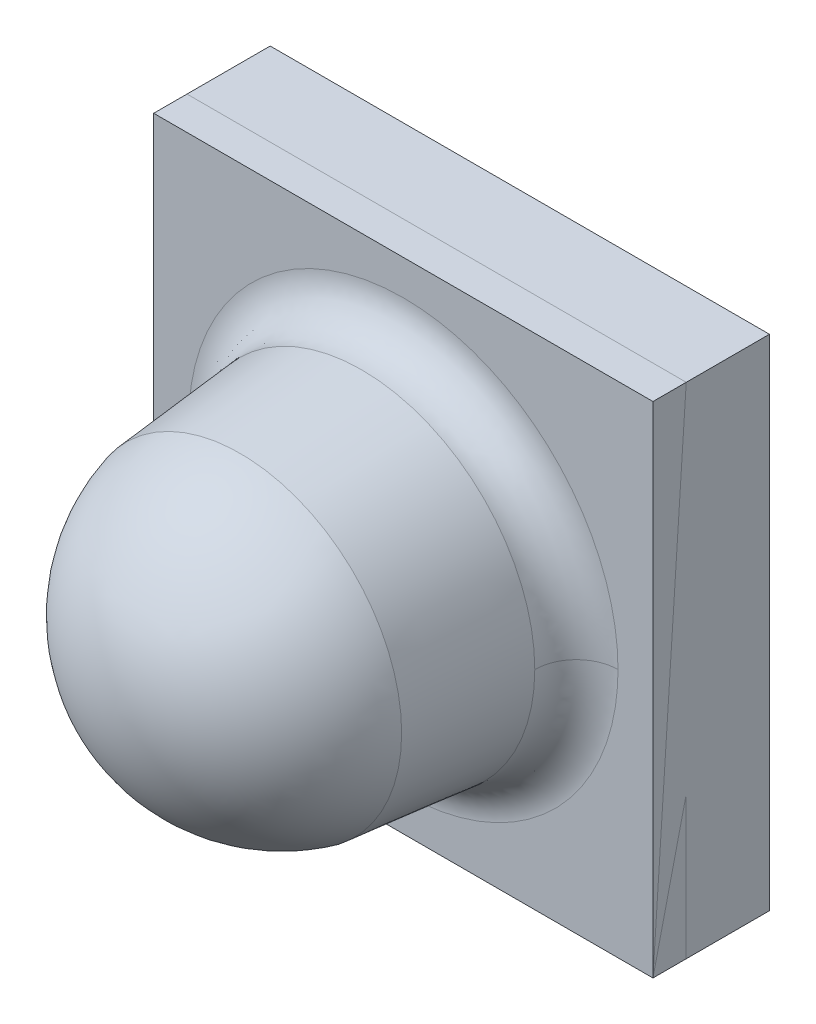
ISO-10303-21;
HEADER;
FILE_DESCRIPTION(('STEP AP214'),'2;1');
FILE_NAME('part.step','',(''),(''),'','','');
FILE_SCHEMA(('AUTOMOTIVE_DESIGN { 1 0 10303 214 1 1 1 1 }'));
ENDSEC;
DATA;
#1=APPLICATION_CONTEXT('core data for automotive mechanical design processes');
#2=APPLICATION_PROTOCOL_DEFINITION('international standard','automotive_design',2000,#1);
#3=PRODUCT_CONTEXT('',#1,'mechanical');
#4=PRODUCT('Part','Part','',(#3));
#5=PRODUCT_RELATED_PRODUCT_CATEGORY('part','',(#4));
#6=PRODUCT_DEFINITION_FORMATION('','',#4);
#7=PRODUCT_DEFINITION_CONTEXT('part definition',#1,'design');
#8=PRODUCT_DEFINITION('design','',#6,#7);
#9=PRODUCT_DEFINITION_SHAPE('','',#8);
#10=(LENGTH_UNIT() NAMED_UNIT(*) SI_UNIT(.MILLI.,.METRE.));
#11=(NAMED_UNIT(*) PLANE_ANGLE_UNIT() SI_UNIT($,.RADIAN.));
#12=(NAMED_UNIT(*) SI_UNIT($,.STERADIAN.) SOLID_ANGLE_UNIT());
#13=UNCERTAINTY_MEASURE_WITH_UNIT(LENGTH_MEASURE(1.E-05),#10,'distance_accuracy_value','');
#14=(GEOMETRIC_REPRESENTATION_CONTEXT(3) GLOBAL_UNCERTAINTY_ASSIGNED_CONTEXT((#13)) GLOBAL_UNIT_ASSIGNED_CONTEXT((#10,
#11,#12)) REPRESENTATION_CONTEXT('',''));
#15=CARTESIAN_POINT('',(0.,0.,0.));
#16=DIRECTION('',(0.,0.,1.));
#17=DIRECTION('',(1.,0.,0.));
#18=AXIS2_PLACEMENT_3D('',#15,#16,#17);
#19=CARTESIAN_POINT('',(-1.5,1.5,0.));
#20=DIRECTION('',(-1.,0.,0.));
#21=DIRECTION('',(0.,0.,1.));
#22=AXIS2_PLACEMENT_3D('',#19,#20,#21);
#23=PLANE('',#22);
#24=DIRECTION('',(0.,-1.,0.));
#25=VECTOR('',#24,1.);
#26=CARTESIAN_POINT('',(-1.5,1.5,0.2));
#27=LINE('',#26,#25);
#28=CARTESIAN_POINT('',(-1.5,1.5,0.2));
#29=VERTEX_POINT('',#28);
#30=CARTESIAN_POINT('',(-1.5,-1.5,0.2));
#31=VERTEX_POINT('',#30);
#32=EDGE_CURVE('P0_E81',#29,#31,#27,.T.);
#33=ORIENTED_EDGE('',*,*,#32,.F.);
#34=DIRECTION('',(0.,0.,1.));
#35=VECTOR('',#34,1.);
#36=CARTESIAN_POINT('',(-1.5,1.5,0.));
#37=LINE('',#36,#35);
#38=CARTESIAN_POINT('',(-1.5,1.5,0.));
#39=VERTEX_POINT('',#38);
#40=EDGE_CURVE('P0_E11',#39,#29,#37,.T.);
#41=ORIENTED_EDGE('',*,*,#40,.F.);
#42=DIRECTION('',(0.,-1.,0.));
#43=VECTOR('',#42,1.);
#44=CARTESIAN_POINT('',(-1.5,1.5,0.));
#45=LINE('',#44,#43);
#46=CARTESIAN_POINT('',(-1.5,-1.5,0.));
#47=VERTEX_POINT('',#46);
#48=EDGE_CURVE('P0_E75',#39,#47,#45,.T.);
#49=ORIENTED_EDGE('',*,*,#48,.T.);
#50=DIRECTION('',(0.,0.,1.));
#51=VECTOR('',#50,1.);
#52=CARTESIAN_POINT('',(-1.5,-1.5,0.));
#53=LINE('',#52,#51);
#54=EDGE_CURVE('P0_E20',#47,#31,#53,.T.);
#55=ORIENTED_EDGE('',*,*,#54,.T.);
#56=EDGE_LOOP('',(#33,#41,#49,#55));
#57=FACE_BOUND('',#56,.T.);
#58=ADVANCED_FACE('P0_F17',(#57),#23,.T.);
#59=CARTESIAN_POINT('',(-1.5,1.5,0.));
#60=DIRECTION('',(0.,1.,0.));
#61=DIRECTION('',(0.,0.,1.));
#62=AXIS2_PLACEMENT_3D('',#59,#60,#61);
#63=PLANE('',#62);
#64=DIRECTION('',(-1.,0.,0.));
#65=VECTOR('',#64,1.);
#66=CARTESIAN_POINT('',(-1.5,1.5,0.2));
#67=LINE('',#66,#65);
#68=CARTESIAN_POINT('',(1.5,1.5,0.2));
#69=VERTEX_POINT('',#68);
#70=EDGE_CURVE('P0_E77',#69,#29,#67,.T.);
#71=ORIENTED_EDGE('',*,*,#70,.F.);
#72=DIRECTION('',(0.,0.,1.));
#73=VECTOR('',#72,1.);
#74=CARTESIAN_POINT('',(1.5,1.5,0.));
#75=LINE('',#74,#73);
#76=CARTESIAN_POINT('',(1.5,1.5,0.));
#77=VERTEX_POINT('',#76);
#78=EDGE_CURVE('P0_E26',#77,#69,#75,.T.);
#79=ORIENTED_EDGE('',*,*,#78,.F.);
#80=DIRECTION('',(-1.,0.,0.));
#81=VECTOR('',#80,1.);
#82=CARTESIAN_POINT('',(-1.5,1.5,0.));
#83=LINE('',#82,#81);
#84=EDGE_CURVE('P0_E72',#77,#39,#83,.T.);
#85=ORIENTED_EDGE('',*,*,#84,.T.);
#86=ORIENTED_EDGE('',*,*,#40,.T.);
#87=EDGE_LOOP('',(#71,#79,#85,#86));
#88=FACE_BOUND('',#87,.T.);
#89=ADVANCED_FACE('P0_F91',(#88),#63,.T.);
#90=CARTESIAN_POINT('',(1.5,1.5,0.));
#91=DIRECTION('',(1.,0.,0.));
#92=DIRECTION('',(0.,0.,-1.));
#93=AXIS2_PLACEMENT_3D('',#90,#91,#92);
#94=PLANE('',#93);
#95=DIRECTION('',(0.,1.,0.));
#96=VECTOR('',#95,1.);
#97=CARTESIAN_POINT('',(1.5,1.5,0.2));
#98=LINE('',#97,#96);
#99=CARTESIAN_POINT('',(1.5,-1.5,0.2));
#100=VERTEX_POINT('',#99);
#101=EDGE_CURVE('P0_E67',#100,#69,#98,.T.);
#102=ORIENTED_EDGE('',*,*,#101,.F.);
#103=DIRECTION('',(0.,0.,1.));
#104=VECTOR('',#103,1.);
#105=CARTESIAN_POINT('',(1.5,-1.5,0.));
#106=LINE('',#105,#104);
#107=CARTESIAN_POINT('',(1.5,-1.5,0.));
#108=VERTEX_POINT('',#107);
#109=EDGE_CURVE('P0_E62',#108,#100,#106,.T.);
#110=ORIENTED_EDGE('',*,*,#109,.F.);
#111=DIRECTION('',(0.,1.,0.));
#112=VECTOR('',#111,1.);
#113=CARTESIAN_POINT('',(1.5,1.5,0.));
#114=LINE('',#113,#112);
#115=EDGE_CURVE('P0_E65',#108,#77,#114,.T.);
#116=ORIENTED_EDGE('',*,*,#115,.T.);
#117=ORIENTED_EDGE('',*,*,#78,.T.);
#118=EDGE_LOOP('',(#102,#110,#116,#117));
#119=FACE_BOUND('',#118,.T.);
#120=ADVANCED_FACE('P0_F64',(#119),#94,.T.);
#121=CARTESIAN_POINT('',(-1.5,-1.5,0.));
#122=DIRECTION('',(0.,-1.,0.));
#123=DIRECTION('',(0.,0.,-1.));
#124=AXIS2_PLACEMENT_3D('',#121,#122,#123);
#125=PLANE('',#124);
#126=DIRECTION('',(1.,0.,0.));
#127=VECTOR('',#126,1.);
#128=CARTESIAN_POINT('',(-1.5,-1.5,0.2));
#129=LINE('',#128,#127);
#130=EDGE_CURVE('P0_E84',#31,#100,#129,.T.);
#131=ORIENTED_EDGE('',*,*,#130,.F.);
#132=ORIENTED_EDGE('',*,*,#54,.F.);
#133=DIRECTION('',(1.,0.,0.));
#134=VECTOR('',#133,1.);
#135=CARTESIAN_POINT('',(-1.5,-1.5,0.));
#136=LINE('',#135,#134);
#137=EDGE_CURVE('P0_E71',#47,#108,#136,.T.);
#138=ORIENTED_EDGE('',*,*,#137,.T.);
#139=ORIENTED_EDGE('',*,*,#109,.T.);
#140=EDGE_LOOP('',(#131,#132,#138,#139));
#141=FACE_BOUND('',#140,.T.);
#142=ADVANCED_FACE('P0_F74',(#141),#125,.T.);
#143=CARTESIAN_POINT('',(0.,0.,0.));
#144=DIRECTION('',(0.,0.,1.));
#145=DIRECTION('',(1.,0.,0.));
#146=AXIS2_PLACEMENT_3D('',#143,#144,#145);
#147=PLANE('',#146);
#148=ORIENTED_EDGE('',*,*,#48,.F.);
#149=ORIENTED_EDGE('',*,*,#84,.F.);
#150=ORIENTED_EDGE('',*,*,#115,.F.);
#151=ORIENTED_EDGE('',*,*,#137,.F.);
#152=EDGE_LOOP('',(#148,#149,#150,#151));
#153=FACE_BOUND('',#152,.T.);
#154=ADVANCED_FACE('P0_F70',(#153),#147,.F.);
#155=CARTESIAN_POINT('',(0.,0.,0.2));
#156=DIRECTION('',(0.,0.,1.));
#157=DIRECTION('',(1.,0.,0.));
#158=AXIS2_PLACEMENT_3D('',#155,#156,#157);
#159=PLANE('',#158);
#160=ORIENTED_EDGE('',*,*,#32,.T.);
#161=ORIENTED_EDGE('',*,*,#130,.T.);
#162=ORIENTED_EDGE('',*,*,#101,.T.);
#163=ORIENTED_EDGE('',*,*,#70,.T.);
#164=EDGE_LOOP('',(#160,#161,#162,#163));
#165=FACE_BOUND('',#164,.T.);
#166=ADVANCED_FACE('P0_F90',(#165),#159,.T.);
#167=CLOSED_SHELL('',(#58,#89,#120,#142,#154,#166));
#168=MANIFOLD_SOLID_BREP('P0_B1',#167);
#169=CARTESIAN_POINT('',(1.5,1.5,-0.5));
#170=DIRECTION('',(-1.,0.,0.));
#171=DIRECTION('',(0.,-1.,0.));
#172=AXIS2_PLACEMENT_3D('',#169,#170,#171);
#173=PLANE('',#172);
#174=DIRECTION('',(0.,0.,-1.));
#175=VECTOR('',#174,1.);
#176=CARTESIAN_POINT('',(1.5,1.5,-0.15));
#177=LINE('',#176,#175);
#178=CARTESIAN_POINT('',(1.5,1.5,0.2));
#179=VERTEX_POINT('',#178);
#180=CARTESIAN_POINT('',(1.5,1.5,-0.5));
#181=VERTEX_POINT('',#180);
#182=EDGE_CURVE('P1_E153',#179,#181,#177,.T.);
#183=ORIENTED_EDGE('',*,*,#182,.F.);
#184=DIRECTION('',(0.,-1.,0.));
#185=VECTOR('',#184,1.);
#186=CARTESIAN_POINT('',(1.5,0.,0.2));
#187=LINE('',#186,#185);
#188=CARTESIAN_POINT('',(1.5,-1.5,0.2));
#189=VERTEX_POINT('',#188);
#190=EDGE_CURVE('P1_E155',#179,#189,#187,.T.);
#191=ORIENTED_EDGE('',*,*,#190,.T.);
#192=DIRECTION('',(0.,0.,1.));
#193=VECTOR('',#192,1.);
#194=CARTESIAN_POINT('',(1.5,-1.5,-0.15));
#195=LINE('',#194,#193);
#196=CARTESIAN_POINT('',(1.5,-1.5,-0.5));
#197=VERTEX_POINT('',#196);
#198=EDGE_CURVE('P1_E173',#197,#189,#195,.T.);
#199=ORIENTED_EDGE('',*,*,#198,.F.);
#200=DIRECTION('',(0.,-1.,0.));
#201=VECTOR('',#200,1.);
#202=CARTESIAN_POINT('',(1.5,0.,-0.5));
#203=LINE('',#202,#201);
#204=EDGE_CURVE('P1_E158',#181,#197,#203,.T.);
#205=ORIENTED_EDGE('',*,*,#204,.F.);
#206=EDGE_LOOP('',(#183,#191,#199,#205));
#207=FACE_BOUND('',#206,.T.);
#208=ADVANCED_FACE('P1_F16',(#207),#173,.F.);
#209=CARTESIAN_POINT('',(-1.5,1.5,-0.5));
#210=DIRECTION('',(0.,-1.,0.));
#211=DIRECTION('',(1.,0.,0.));
#212=AXIS2_PLACEMENT_3D('',#209,#210,#211);
#213=PLANE('',#212);
#214=DIRECTION('',(0.,0.,-1.));
#215=VECTOR('',#214,1.);
#216=CARTESIAN_POINT('',(-1.5,1.5,-0.15));
#217=LINE('',#216,#215);
#218=CARTESIAN_POINT('',(-1.5,1.5,0.2));
#219=VERTEX_POINT('',#218);
#220=CARTESIAN_POINT('',(-1.5,1.5,-0.5));
#221=VERTEX_POINT('',#220);
#222=EDGE_CURVE('P1_E176',#219,#221,#217,.T.);
#223=ORIENTED_EDGE('',*,*,#222,.F.);
#224=DIRECTION('',(1.,0.,0.));
#225=VECTOR('',#224,1.);
#226=CARTESIAN_POINT('',(0.,1.5,0.2));
#227=LINE('',#226,#225);
#228=EDGE_CURVE('P1_E169',#219,#179,#227,.T.);
#229=ORIENTED_EDGE('',*,*,#228,.T.);
#230=ORIENTED_EDGE('',*,*,#182,.T.);
#231=DIRECTION('',(1.,0.,0.));
#232=VECTOR('',#231,1.);
#233=CARTESIAN_POINT('',(0.,1.5,-0.5));
#234=LINE('',#233,#232);
#235=EDGE_CURVE('P1_E177',#221,#181,#234,.T.);
#236=ORIENTED_EDGE('',*,*,#235,.F.);
#237=EDGE_LOOP('',(#223,#229,#230,#236));
#238=FACE_BOUND('',#237,.T.);
#239=ADVANCED_FACE('P1_F175',(#238),#213,.F.);
#240=CARTESIAN_POINT('',(-1.5,-1.5,0.2));
#241=DIRECTION('',(1.,0.,0.));
#242=DIRECTION('',(0.,0.,-1.));
#243=AXIS2_PLACEMENT_3D('',#240,#241,#242);
#244=PLANE('',#243);
#245=DIRECTION('',(0.,0.,-1.));
#246=VECTOR('',#245,1.);
#247=CARTESIAN_POINT('',(-1.5,-1.5,-0.15));
#248=LINE('',#247,#246);
#249=CARTESIAN_POINT('',(-1.5,-1.5,0.2));
#250=VERTEX_POINT('',#249);
#251=CARTESIAN_POINT('',(-1.5,-1.5,-0.5));
#252=VERTEX_POINT('',#251);
#253=EDGE_CURVE('P1_E179',#250,#252,#248,.T.);
#254=ORIENTED_EDGE('',*,*,#253,.F.);
#255=DIRECTION('',(0.,1.,0.));
#256=VECTOR('',#255,1.);
#257=CARTESIAN_POINT('',(-1.5,0.,0.2));
#258=LINE('',#257,#256);
#259=EDGE_CURVE('P1_E185',#250,#219,#258,.T.);
#260=ORIENTED_EDGE('',*,*,#259,.T.);
#261=ORIENTED_EDGE('',*,*,#222,.T.);
#262=DIRECTION('',(0.,1.,0.));
#263=VECTOR('',#262,1.);
#264=CARTESIAN_POINT('',(-1.5,0.,-0.5));
#265=LINE('',#264,#263);
#266=EDGE_CURVE('P1_E187',#252,#221,#265,.T.);
#267=ORIENTED_EDGE('',*,*,#266,.F.);
#268=EDGE_LOOP('',(#254,#260,#261,#267));
#269=FACE_BOUND('',#268,.T.);
#270=ADVANCED_FACE('P1_F342',(#269),#244,.F.);
#271=CARTESIAN_POINT('',(-1.5,-1.5,-0.5));
#272=DIRECTION('',(0.,1.,0.));
#273=DIRECTION('',(0.,0.,1.));
#274=AXIS2_PLACEMENT_3D('',#271,#272,#273);
#275=PLANE('',#274);
#276=ORIENTED_EDGE('',*,*,#198,.T.);
#277=DIRECTION('',(-1.,0.,0.));
#278=VECTOR('',#277,1.);
#279=CARTESIAN_POINT('',(0.,-1.5,0.2));
#280=LINE('',#279,#278);
#281=EDGE_CURVE('P1_E172',#189,#250,#280,.T.);
#282=ORIENTED_EDGE('',*,*,#281,.T.);
#283=ORIENTED_EDGE('',*,*,#253,.T.);
#284=DIRECTION('',(-1.,0.,0.));
#285=VECTOR('',#284,1.);
#286=CARTESIAN_POINT('',(0.,-1.5,-0.5));
#287=LINE('',#286,#285);
#288=EDGE_CURVE('P1_E191',#197,#252,#287,.T.);
#289=ORIENTED_EDGE('',*,*,#288,.F.);
#290=EDGE_LOOP('',(#276,#282,#283,#289));
#291=FACE_BOUND('',#290,.T.);
#292=ADVANCED_FACE('P1_F344',(#291),#275,.F.);
#293=CARTESIAN_POINT('',(1.5,-1.5,0.2));
#294=DIRECTION('',(0.,0.,-1.));
#295=DIRECTION('',(-1.,0.,0.));
#296=AXIS2_PLACEMENT_3D('',#293,#294,#295);
#297=PLANE('',#296);
#298=CARTESIAN_POINT('',(1.28999999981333,0.,0.200000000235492));
#299=CARTESIAN_POINT('',(1.28999999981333,2.57999999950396,0.200000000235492));
#300=CARTESIAN_POINT('',(-1.28999999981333,2.57999999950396,0.200000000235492));
#301=CARTESIAN_POINT('',(-1.28999999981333,0.,0.200000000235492));
#302=(BOUNDED_CURVE() B_SPLINE_CURVE(3,(#298,#299,#300,#301),.UNSPECIFIED.,.F.,
.F.) B_SPLINE_CURVE_WITH_KNOTS((4,4),(0.,1.),
.UNSPECIFIED.) CURVE() GEOMETRIC_REPRESENTATION_ITEM() RATIONAL_B_SPLINE_CURVE((0.956578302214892,
0.318859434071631,0.318859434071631,0.956578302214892)) REPRESENTATION_ITEM(''));
#303=CARTESIAN_POINT('',(1.28999999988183,0.,0.200000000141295));
#304=VERTEX_POINT('',#303);
#305=CARTESIAN_POINT('',(-1.28999999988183,0.,0.200000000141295));
#306=VERTEX_POINT('',#305);
#307=EDGE_CURVE('P1_E194',#304,#306,#302,.T.);
#308=ORIENTED_EDGE('',*,*,#307,.F.);
#309=CARTESIAN_POINT('',(-1.28999999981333,0.,0.200000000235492));
#310=CARTESIAN_POINT('',(-1.28999999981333,-2.57999999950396,0.200000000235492));
#311=CARTESIAN_POINT('',(1.28999999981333,-2.57999999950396,0.200000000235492));
#312=CARTESIAN_POINT('',(1.28999999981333,0.,0.200000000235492));
#313=(BOUNDED_CURVE() B_SPLINE_CURVE(3,(#309,#310,#311,#312),.UNSPECIFIED.,.F.,
.F.) B_SPLINE_CURVE_WITH_KNOTS((4,4),(0.,1.),
.UNSPECIFIED.) CURVE() GEOMETRIC_REPRESENTATION_ITEM() RATIONAL_B_SPLINE_CURVE((0.956578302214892,
0.318859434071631,0.318859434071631,0.956578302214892)) REPRESENTATION_ITEM(''));
#314=EDGE_CURVE('P1_E199',#304,#306,#313,.F.);
#315=ORIENTED_EDGE('',*,*,#314,.T.);
#316=EDGE_LOOP('',(#308,#315));
#317=FACE_BOUND('',#316,.T.);
#318=ORIENTED_EDGE('',*,*,#228,.F.);
#319=ORIENTED_EDGE('',*,*,#259,.F.);
#320=ORIENTED_EDGE('',*,*,#281,.F.);
#321=ORIENTED_EDGE('',*,*,#190,.F.);
#322=EDGE_LOOP('',(#318,#319,#320,#321));
#323=FACE_BOUND('',#322,.T.);
#324=ADVANCED_FACE('P1_F167',(#317,#323),#297,.F.);
#325=CARTESIAN_POINT('',(-1.041248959,0.,0.474958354));
#326=CARTESIAN_POINT('',(-1.041248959,2.082497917,0.474958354));
#327=CARTESIAN_POINT('',(1.041248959,2.082497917,0.474958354));
#328=CARTESIAN_POINT('',(1.041248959,0.,0.474958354));
#329=CARTESIAN_POINT('',(-1.024194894,0.,0.304986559));
#330=CARTESIAN_POINT('',(-1.024194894,2.048389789,0.304986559));
#331=CARTESIAN_POINT('',(1.024194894,2.048389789,0.304986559));
#332=CARTESIAN_POINT('',(1.024194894,0.,0.304986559));
#333=CARTESIAN_POINT('',(-1.144986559,0.,0.184194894));
#334=CARTESIAN_POINT('',(-1.144986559,2.289973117,0.184194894));
#335=CARTESIAN_POINT('',(1.144986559,2.289973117,0.184194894));
#336=CARTESIAN_POINT('',(1.144986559,0.,0.184194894));
#337=CARTESIAN_POINT('',(-1.314958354,0.,0.201248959));
#338=CARTESIAN_POINT('',(-1.314958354,2.629916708,0.201248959));
#339=CARTESIAN_POINT('',(1.314958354,2.629916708,0.201248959));
#340=CARTESIAN_POINT('',(1.314958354,0.,0.201248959));
#341=(BOUNDED_SURFACE() B_SPLINE_SURFACE(3,3,((#325,#326,#327,#328),(#329,#330,#331,#332),(#333,
#334,#335,#336),(#337,#338,#339,#340)),.UNSPECIFIED.,.F.,.F.,
.F.) B_SPLINE_SURFACE_WITH_KNOTS((4,4),(4,4),(0.,1.),(0.,1.),
.UNSPECIFIED.) GEOMETRIC_REPRESENTATION_ITEM() RATIONAL_B_SPLINE_SURFACE(((1.,0.333333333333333,
0.333333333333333,1.),(0.755320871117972,0.251773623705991,0.251773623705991,0.755320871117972),
(0.755320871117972,0.251773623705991,0.251773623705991,0.755320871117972),(1.,0.333333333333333,
0.333333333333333,1.))) REPRESENTATION_ITEM('') SURFACE());
#342=CARTESIAN_POINT('',(-1.041248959,0.,0.474958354));
#343=CARTESIAN_POINT('',(-1.024194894,0.,0.304986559));
#344=CARTESIAN_POINT('',(-1.144986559,0.,0.184194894));
#345=CARTESIAN_POINT('',(-1.314958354,0.,0.201248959));
#346=(BOUNDED_CURVE() B_SPLINE_CURVE(3,(#342,#343,#344,#345),.UNSPECIFIED.,.F.,
.F.) B_SPLINE_CURVE_WITH_KNOTS((4,4),(0.,1.),
.UNSPECIFIED.) CURVE() GEOMETRIC_REPRESENTATION_ITEM() RATIONAL_B_SPLINE_CURVE((1.,
0.755320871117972,0.755320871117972,1.)) REPRESENTATION_ITEM(''));
#347=CARTESIAN_POINT('',(-1.04000000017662,-2.33463433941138E-11,0.449999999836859));
#348=VERTEX_POINT('',#347);
#349=EDGE_CURVE('P1_E195',#348,#306,#346,.T.);
#350=CARTESIAN_POINT('',(0.,0.,0.449999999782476));
#351=DIRECTION('',(0.,0.,1.));
#352=DIRECTION('',(1.,0.,0.));
#353=AXIS2_PLACEMENT_3D('',#350,#351,#352);
#354=CIRCLE('',#353,1.04000000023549);
#355=CARTESIAN_POINT('',(1.04000000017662,-1.06653782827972E-10,0.449999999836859));
#356=VERTEX_POINT('',#355);
#357=EDGE_CURVE('P1_E198',#356,#348,#354,.T.);
#358=CARTESIAN_POINT('',(1.041248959,0.,0.474958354));
#359=CARTESIAN_POINT('',(1.024194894,0.,0.304986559));
#360=CARTESIAN_POINT('',(1.144986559,0.,0.184194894));
#361=CARTESIAN_POINT('',(1.314958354,0.,0.201248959));
#362=(BOUNDED_CURVE() B_SPLINE_CURVE(3,(#358,#359,#360,#361),.UNSPECIFIED.,.F.,
.F.) B_SPLINE_CURVE_WITH_KNOTS((4,4),(0.,1.),
.UNSPECIFIED.) CURVE() GEOMETRIC_REPRESENTATION_ITEM() RATIONAL_B_SPLINE_CURVE((1.,
0.755320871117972,0.755320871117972,1.)) REPRESENTATION_ITEM(''));
#363=EDGE_CURVE('P1_E209',#304,#356,#362,.F.);
#364=ORIENTED_EDGE('',*,*,#307,.T.);
#365=ORIENTED_EDGE('',*,*,#349,.F.);
#366=ORIENTED_EDGE('',*,*,#357,.F.);
#367=ORIENTED_EDGE('',*,*,#363,.F.);
#368=EDGE_LOOP('',(#364,#365,#366,#367));
#369=FACE_BOUND('',#368,.T.);
#370=ADVANCED_FACE('P1_F556',(#369),#341,.F.);
#371=CARTESIAN_POINT('',(1.041248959,0.,0.474958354));
#372=CARTESIAN_POINT('',(1.041248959,-2.082497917,0.474958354));
#373=CARTESIAN_POINT('',(-1.041248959,-2.082497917,0.474958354));
#374=CARTESIAN_POINT('',(-1.041248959,0.,0.474958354));
#375=CARTESIAN_POINT('',(1.024194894,0.,0.304986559));
#376=CARTESIAN_POINT('',(1.024194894,-2.048389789,0.304986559));
#377=CARTESIAN_POINT('',(-1.024194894,-2.048389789,0.304986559));
#378=CARTESIAN_POINT('',(-1.024194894,0.,0.304986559));
#379=CARTESIAN_POINT('',(1.144986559,0.,0.184194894));
#380=CARTESIAN_POINT('',(1.144986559,-2.289973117,0.184194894));
#381=CARTESIAN_POINT('',(-1.144986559,-2.289973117,0.184194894));
#382=CARTESIAN_POINT('',(-1.144986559,0.,0.184194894));
#383=CARTESIAN_POINT('',(1.314958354,0.,0.201248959));
#384=CARTESIAN_POINT('',(1.314958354,-2.629916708,0.201248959));
#385=CARTESIAN_POINT('',(-1.314958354,-2.629916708,0.201248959));
#386=CARTESIAN_POINT('',(-1.314958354,0.,0.201248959));
#387=(BOUNDED_SURFACE() B_SPLINE_SURFACE(3,3,((#371,#372,#373,#374),(#375,#376,#377,#378),(#379,
#380,#381,#382),(#383,#384,#385,#386)),.UNSPECIFIED.,.F.,.F.,
.F.) B_SPLINE_SURFACE_WITH_KNOTS((4,4),(4,4),(0.,1.),(0.,1.),
.UNSPECIFIED.) GEOMETRIC_REPRESENTATION_ITEM() RATIONAL_B_SPLINE_SURFACE(((1.,0.333333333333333,
0.333333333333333,1.),(0.755320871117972,0.251773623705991,0.251773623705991,0.755320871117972),
(0.755320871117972,0.251773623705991,0.251773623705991,0.755320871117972),(1.,0.333333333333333,
0.333333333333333,1.))) REPRESENTATION_ITEM('') SURFACE());
#388=CARTESIAN_POINT('',(0.,0.,0.449999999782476));
#389=DIRECTION('',(0.,0.,1.));
#390=DIRECTION('',(1.,0.,0.));
#391=AXIS2_PLACEMENT_3D('',#388,#389,#390);
#392=CIRCLE('',#391,1.04000000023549);
#393=EDGE_CURVE('P1_E214',#348,#356,#392,.T.);
#394=ORIENTED_EDGE('',*,*,#363,.T.);
#395=ORIENTED_EDGE('',*,*,#393,.F.);
#396=ORIENTED_EDGE('',*,*,#349,.T.);
#397=ORIENTED_EDGE('',*,*,#314,.F.);
#398=EDGE_LOOP('',(#394,#395,#396,#397));
#399=FACE_BOUND('',#398,.T.);
#400=ADVANCED_FACE('P1_F546',(#399),#387,.F.);
#401=CARTESIAN_POINT('',(0.,0.,1.18));
#402=DIRECTION('',(0.,0.,-1.));
#403=DIRECTION('',(0.,1.,0.));
#404=AXIS2_PLACEMENT_3D('',#401,#402,#403);
#405=CONICAL_SURFACE('',#404,0.97,0.0955981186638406);
#406=ORIENTED_EDGE('',*,*,#357,.T.);
#407=ORIENTED_EDGE('',*,*,#393,.T.);
#408=EDGE_LOOP('',(#406,#407));
#409=FACE_BOUND('',#408,.T.);
#410=CARTESIAN_POINT('',(0.,0.,1.1799999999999));
#411=DIRECTION('',(0.,0.,-1.));
#412=DIRECTION('',(-1.,0.,0.));
#413=AXIS2_PLACEMENT_3D('',#410,#411,#412);
#414=CIRCLE('',#413,0.97);
#415=CARTESIAN_POINT('',(-0.97,0.,1.18));
#416=VERTEX_POINT('',#415);
#417=EDGE_CURVE('P1_E224',#416,#416,#414,.F.);
#418=ORIENTED_EDGE('',*,*,#417,.F.);
#419=EDGE_LOOP('',(#418));
#420=FACE_BOUND('',#419,.T.);
#421=ADVANCED_FACE('P1_F356',(#409,#420),#405,.T.);
#422=CARTESIAN_POINT('',(0.,3.33330030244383E-10,0.92773333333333));
#423=DIRECTION('',(0.,0.,-1.));
#424=DIRECTION('',(1.,0.,0.));
#425=AXIS2_PLACEMENT_3D('',#422,#423,#424);
#426=SPHERICAL_SURFACE('',#425,1.002266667);
#427=CARTESIAN_POINT('',(-1.00226667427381E-08,0.,1.93000000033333));
#428=VERTEX_POINT('',#427);
#429=VERTEX_LOOP('',#428);
#430=FACE_BOUND('',#429,.T.);
#431=ORIENTED_EDGE('',*,*,#417,.T.);
#432=EDGE_LOOP('',(#431));
#433=FACE_BOUND('',#432,.T.);
#434=ADVANCED_FACE('P1_F336',(#430,#433),#426,.T.);
#435=CARTESIAN_POINT('',(1.5,-1.5,-0.5));
#436=DIRECTION('',(0.,0.,-1.));
#437=DIRECTION('',(-1.,0.,0.));
#438=AXIS2_PLACEMENT_3D('',#435,#436,#437);
#439=PLANE('',#438);
#440=DIRECTION('',(-0.707106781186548,0.707106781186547,0.));
#441=VECTOR('',#440,1.);
#442=CARTESIAN_POINT('',(1.35,1.100000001,-0.5));
#443=LINE('',#442,#441);
#444=CARTESIAN_POINT('',(1.35,1.1000000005,-0.5));
#445=VERTEX_POINT('',#444);
#446=CARTESIAN_POINT('',(1.1000000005,1.35,-0.5));
#447=VERTEX_POINT('',#446);
#448=EDGE_CURVE('P1_E229',#445,#447,#443,.T.);
#449=ORIENTED_EDGE('',*,*,#448,.T.);
#450=DIRECTION('',(-1.,0.,0.));
#451=VECTOR('',#450,1.);
#452=CARTESIAN_POINT('',(0.,1.35,-0.5));
#453=LINE('',#452,#451);
#454=CARTESIAN_POINT('',(0.84999999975,1.35,-0.5));
#455=VERTEX_POINT('',#454);
#456=EDGE_CURVE('P1_E231',#447,#455,#453,.T.);
#457=ORIENTED_EDGE('',*,*,#456,.T.);
#458=DIRECTION('',(0.,-1.,0.));
#459=VECTOR('',#458,1.);
#460=CARTESIAN_POINT('',(0.849999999,0.,-0.5));
#461=LINE('',#460,#459);
#462=CARTESIAN_POINT('',(0.84999999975,-1.35,-0.5));
#463=VERTEX_POINT('',#462);
#464=EDGE_CURVE('P1_E233',#455,#463,#461,.T.);
#465=ORIENTED_EDGE('',*,*,#464,.T.);
#466=DIRECTION('',(1.,0.,0.));
#467=VECTOR('',#466,1.);
#468=CARTESIAN_POINT('',(0.,-1.35,-0.5));
#469=LINE('',#468,#467);
#470=CARTESIAN_POINT('',(1.35,-1.35,-0.5));
#471=VERTEX_POINT('',#470);
#472=EDGE_CURVE('P1_E235',#463,#471,#469,.T.);
#473=ORIENTED_EDGE('',*,*,#472,.T.);
#474=DIRECTION('',(0.,1.,0.));
#475=VECTOR('',#474,1.);
#476=CARTESIAN_POINT('',(1.35,0.,-0.5));
#477=LINE('',#476,#475);
#478=EDGE_CURVE('P1_E237',#471,#445,#477,.T.);
#479=ORIENTED_EDGE('',*,*,#478,.T.);
#480=EDGE_LOOP('',(#449,#457,#465,#473,#479));
#481=FACE_BOUND('',#480,.T.);
#482=DIRECTION('',(0.,1.,0.));
#483=VECTOR('',#482,1.);
#484=CARTESIAN_POINT('',(-0.849999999,0.,-0.5));
#485=LINE('',#484,#483);
#486=CARTESIAN_POINT('',(-0.84999999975,-1.35,-0.5));
#487=VERTEX_POINT('',#486);
#488=CARTESIAN_POINT('',(-0.84999999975,1.35,-0.5));
#489=VERTEX_POINT('',#488);
#490=EDGE_CURVE('P1_E240',#487,#489,#485,.T.);
#491=ORIENTED_EDGE('',*,*,#490,.T.);
#492=DIRECTION('',(-1.,0.,0.));
#493=VECTOR('',#492,1.);
#494=CARTESIAN_POINT('',(0.,1.35,-0.5));
#495=LINE('',#494,#493);
#496=CARTESIAN_POINT('',(-1.35,1.35,-0.5));
#497=VERTEX_POINT('',#496);
#498=EDGE_CURVE('P1_E242',#489,#497,#495,.T.);
#499=ORIENTED_EDGE('',*,*,#498,.T.);
#500=DIRECTION('',(0.,-1.,0.));
#501=VECTOR('',#500,1.);
#502=CARTESIAN_POINT('',(-1.35,0.,-0.5));
#503=LINE('',#502,#501);
#504=CARTESIAN_POINT('',(-1.35,-1.35,-0.5));
#505=VERTEX_POINT('',#504);
#506=EDGE_CURVE('P1_E244',#497,#505,#503,.T.);
#507=ORIENTED_EDGE('',*,*,#506,.T.);
#508=DIRECTION('',(1.,0.,0.));
#509=VECTOR('',#508,1.);
#510=CARTESIAN_POINT('',(0.,-1.35,-0.5));
#511=LINE('',#510,#509);
#512=EDGE_CURVE('P1_E246',#505,#487,#511,.T.);
#513=ORIENTED_EDGE('',*,*,#512,.T.);
#514=EDGE_LOOP('',(#491,#499,#507,#513));
#515=FACE_BOUND('',#514,.T.);
#516=DIRECTION('',(0.,1.,0.));
#517=VECTOR('',#516,1.);
#518=CARTESIAN_POINT('',(0.500000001,0.,-0.5));
#519=LINE('',#518,#517);
#520=CARTESIAN_POINT('',(0.50000000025,-1.35,-0.5));
#521=VERTEX_POINT('',#520);
#522=CARTESIAN_POINT('',(0.50000000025,1.35,-0.5));
#523=VERTEX_POINT('',#522);
#524=EDGE_CURVE('P1_E249',#521,#523,#519,.T.);
#525=ORIENTED_EDGE('',*,*,#524,.T.);
#526=DIRECTION('',(-1.,0.,0.));
#527=VECTOR('',#526,1.);
#528=CARTESIAN_POINT('',(0.,1.35,-0.5));
#529=LINE('',#528,#527);
#530=CARTESIAN_POINT('',(-0.50000000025,1.35,-0.5));
#531=VERTEX_POINT('',#530);
#532=EDGE_CURVE('P1_E251',#523,#531,#529,.T.);
#533=ORIENTED_EDGE('',*,*,#532,.T.);
#534=DIRECTION('',(0.,-1.,0.));
#535=VECTOR('',#534,1.);
#536=CARTESIAN_POINT('',(-0.500000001,0.,-0.5));
#537=LINE('',#536,#535);
#538=CARTESIAN_POINT('',(-0.50000000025,-1.35,-0.5));
#539=VERTEX_POINT('',#538);
#540=EDGE_CURVE('P1_E253',#531,#539,#537,.T.);
#541=ORIENTED_EDGE('',*,*,#540,.T.);
#542=DIRECTION('',(1.,0.,0.));
#543=VECTOR('',#542,1.);
#544=CARTESIAN_POINT('',(0.,-1.35,-0.5));
#545=LINE('',#544,#543);
#546=EDGE_CURVE('P1_E255',#539,#521,#545,.T.);
#547=ORIENTED_EDGE('',*,*,#546,.T.);
#548=EDGE_LOOP('',(#525,#533,#541,#547));
#549=FACE_BOUND('',#548,.T.);
#550=ORIENTED_EDGE('',*,*,#266,.T.);
#551=ORIENTED_EDGE('',*,*,#235,.T.);
#552=ORIENTED_EDGE('',*,*,#204,.T.);
#553=ORIENTED_EDGE('',*,*,#288,.T.);
#554=EDGE_LOOP('',(#550,#551,#552,#553));
#555=FACE_BOUND('',#554,.T.);
#556=ADVANCED_FACE('P1_F332',(#481,#515,#549,#555),#439,.T.);
#557=CARTESIAN_POINT('',(1.1,1.35,-0.58));
#558=DIRECTION('',(-0.707106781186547,-0.707106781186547,0.));
#559=DIRECTION('',(0.707106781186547,-0.707106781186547,0.));
#560=AXIS2_PLACEMENT_3D('',#557,#558,#559);
#561=PLANE('',#560);
#562=DIRECTION('',(0.,0.,1.));
#563=VECTOR('',#562,1.);
#564=CARTESIAN_POINT('',(1.35,1.1,-0.54));
#565=LINE('',#564,#563);
#566=CARTESIAN_POINT('',(1.35,1.1,-0.58));
#567=VERTEX_POINT('',#566);
#568=EDGE_CURVE('P1_E258',#567,#445,#565,.T.);
#569=ORIENTED_EDGE('',*,*,#568,.F.);
#570=DIRECTION('',(0.707106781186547,-0.707106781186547,0.));
#571=VECTOR('',#570,1.);
#572=CARTESIAN_POINT('',(1.1,1.35,-0.58));
#573=LINE('',#572,#571);
#574=CARTESIAN_POINT('',(1.1,1.35,-0.58));
#575=VERTEX_POINT('',#574);
#576=EDGE_CURVE('P1_E261',#567,#575,#573,.F.);
#577=ORIENTED_EDGE('',*,*,#576,.T.);
#578=DIRECTION('',(0.,0.,1.));
#579=VECTOR('',#578,1.);
#580=CARTESIAN_POINT('',(1.1,1.35,-0.54));
#581=LINE('',#580,#579);
#582=EDGE_CURVE('P1_E263',#575,#447,#581,.T.);
#583=ORIENTED_EDGE('',*,*,#582,.T.);
#584=ORIENTED_EDGE('',*,*,#448,.F.);
#585=EDGE_LOOP('',(#569,#577,#583,#584));
#586=FACE_BOUND('',#585,.T.);
#587=ADVANCED_FACE('P1_F335',(#586),#561,.F.);
#588=CARTESIAN_POINT('',(1.35,-1.35,-0.58));
#589=DIRECTION('',(-1.,0.,0.));
#590=DIRECTION('',(0.,0.,1.));
#591=AXIS2_PLACEMENT_3D('',#588,#589,#590);
#592=PLANE('',#591);
#593=DIRECTION('',(0.,0.,1.));
#594=VECTOR('',#593,1.);
#595=CARTESIAN_POINT('',(1.35,-1.35,-0.54));
#596=LINE('',#595,#594);
#597=CARTESIAN_POINT('',(1.35,-1.35,-0.58));
#598=VERTEX_POINT('',#597);
#599=EDGE_CURVE('P1_E266',#598,#471,#596,.T.);
#600=ORIENTED_EDGE('',*,*,#599,.F.);
#601=DIRECTION('',(0.,-1.,0.));
#602=VECTOR('',#601,1.);
#603=CARTESIAN_POINT('',(1.35,-0.125,-0.58));
#604=LINE('',#603,#602);
#605=EDGE_CURVE('P1_E269',#567,#598,#604,.T.);
#606=ORIENTED_EDGE('',*,*,#605,.F.);
#607=ORIENTED_EDGE('',*,*,#568,.T.);
#608=ORIENTED_EDGE('',*,*,#478,.F.);
#609=EDGE_LOOP('',(#600,#606,#607,#608));
#610=FACE_BOUND('',#609,.T.);
#611=ADVANCED_FACE('P1_F361',(#610),#592,.F.);
#612=CARTESIAN_POINT('',(0.85,-1.35,-0.58));
#613=DIRECTION('',(0.,1.,0.));
#614=DIRECTION('',(0.,0.,1.));
#615=AXIS2_PLACEMENT_3D('',#612,#613,#614);
#616=PLANE('',#615);
#617=DIRECTION('',(0.,0.,1.));
#618=VECTOR('',#617,1.);
#619=CARTESIAN_POINT('',(0.85,-1.35,-0.54));
#620=LINE('',#619,#618);
#621=CARTESIAN_POINT('',(0.85,-1.35,-0.58));
#622=VERTEX_POINT('',#621);
#623=EDGE_CURVE('P1_E272',#622,#463,#620,.T.);
#624=ORIENTED_EDGE('',*,*,#623,.F.);
#625=DIRECTION('',(-1.,0.,0.));
#626=VECTOR('',#625,1.);
#627=CARTESIAN_POINT('',(1.1,-1.35,-0.58));
#628=LINE('',#627,#626);
#629=EDGE_CURVE('P1_E275',#598,#622,#628,.T.);
#630=ORIENTED_EDGE('',*,*,#629,.F.);
#631=ORIENTED_EDGE('',*,*,#599,.T.);
#632=ORIENTED_EDGE('',*,*,#472,.F.);
#633=EDGE_LOOP('',(#624,#630,#631,#632));
#634=FACE_BOUND('',#633,.T.);
#635=ADVANCED_FACE('P1_F365',(#634),#616,.F.);
#636=CARTESIAN_POINT('',(0.85,-1.35,-0.5));
#637=DIRECTION('',(1.,0.,0.));
#638=DIRECTION('',(0.,0.,-1.));
#639=AXIS2_PLACEMENT_3D('',#636,#637,#638);
#640=PLANE('',#639);
#641=DIRECTION('',(0.,0.,-1.));
#642=VECTOR('',#641,1.);
#643=CARTESIAN_POINT('',(0.85,1.35,-0.54));
#644=LINE('',#643,#642);
#645=CARTESIAN_POINT('',(0.85,1.35,-0.58));
#646=VERTEX_POINT('',#645);
#647=EDGE_CURVE('P1_E278',#455,#646,#644,.T.);
#648=ORIENTED_EDGE('',*,*,#647,.T.);
#649=DIRECTION('',(0.,1.,0.));
#650=VECTOR('',#649,1.);
#651=CARTESIAN_POINT('',(0.85,0.,-0.58));
#652=LINE('',#651,#650);
#653=EDGE_CURVE('P1_E280',#622,#646,#652,.T.);
#654=ORIENTED_EDGE('',*,*,#653,.F.);
#655=ORIENTED_EDGE('',*,*,#623,.T.);
#656=ORIENTED_EDGE('',*,*,#464,.F.);
#657=EDGE_LOOP('',(#648,#654,#655,#656));
#658=FACE_BOUND('',#657,.T.);
#659=ADVANCED_FACE('P1_F369',(#658),#640,.F.);
#660=CARTESIAN_POINT('',(0.85,1.35,-0.5));
#661=DIRECTION('',(0.,-1.,0.));
#662=DIRECTION('',(0.,0.,-1.));
#663=AXIS2_PLACEMENT_3D('',#660,#661,#662);
#664=PLANE('',#663);
#665=ORIENTED_EDGE('',*,*,#582,.F.);
#666=DIRECTION('',(-1.,0.,0.));
#667=VECTOR('',#666,1.);
#668=CARTESIAN_POINT('',(1.1,1.35,-0.58));
#669=LINE('',#668,#667);
#670=EDGE_CURVE('P1_E283',#575,#646,#669,.T.);
#671=ORIENTED_EDGE('',*,*,#670,.T.);
#672=ORIENTED_EDGE('',*,*,#647,.F.);
#673=ORIENTED_EDGE('',*,*,#456,.F.);
#674=EDGE_LOOP('',(#665,#671,#672,#673));
#675=FACE_BOUND('',#674,.T.);
#676=ADVANCED_FACE('P1_F373',(#675),#664,.F.);
#677=CARTESIAN_POINT('',(0.85,-1.35,-0.58));
#678=DIRECTION('',(0.,0.,1.));
#679=DIRECTION('',(1.,0.,0.));
#680=AXIS2_PLACEMENT_3D('',#677,#678,#679);
#681=PLANE('',#680);
#682=ORIENTED_EDGE('',*,*,#653,.T.);
#683=ORIENTED_EDGE('',*,*,#670,.F.);
#684=ORIENTED_EDGE('',*,*,#576,.F.);
#685=ORIENTED_EDGE('',*,*,#605,.T.);
#686=ORIENTED_EDGE('',*,*,#629,.T.);
#687=EDGE_LOOP('',(#682,#683,#684,#685,#686));
#688=FACE_BOUND('',#687,.T.);
#689=ADVANCED_FACE('P1_F377',(#688),#681,.F.);
#690=CARTESIAN_POINT('',(-0.85,1.35,-0.58));
#691=DIRECTION('',(-1.,0.,0.));
#692=DIRECTION('',(0.,-1.,0.));
#693=AXIS2_PLACEMENT_3D('',#690,#691,#692);
#694=PLANE('',#693);
#695=DIRECTION('',(0.,0.,1.));
#696=VECTOR('',#695,1.);
#697=CARTESIAN_POINT('',(-0.85,-1.35,-0.54));
#698=LINE('',#697,#696);
#699=CARTESIAN_POINT('',(-0.85,-1.35,-0.58));
#700=VERTEX_POINT('',#699);
#701=EDGE_CURVE('P1_E286',#700,#487,#698,.T.);
#702=ORIENTED_EDGE('',*,*,#701,.F.);
#703=DIRECTION('',(0.,-1.,0.));
#704=VECTOR('',#703,1.);
#705=CARTESIAN_POINT('',(-0.85,0.,-0.58));
#706=LINE('',#705,#704);
#707=CARTESIAN_POINT('',(-0.85,1.35,-0.58));
#708=VERTEX_POINT('',#707);
#709=EDGE_CURVE('P1_E289',#708,#700,#706,.T.);
#710=ORIENTED_EDGE('',*,*,#709,.F.);
#711=DIRECTION('',(0.,0.,1.));
#712=VECTOR('',#711,1.);
#713=CARTESIAN_POINT('',(-0.85,1.35,-0.54));
#714=LINE('',#713,#712);
#715=EDGE_CURVE('P1_E292',#708,#489,#714,.T.);
#716=ORIENTED_EDGE('',*,*,#715,.T.);
#717=ORIENTED_EDGE('',*,*,#490,.F.);
#718=EDGE_LOOP('',(#702,#710,#716,#717));
#719=FACE_BOUND('',#718,.T.);
#720=ADVANCED_FACE('P1_F381',(#719),#694,.F.);
#721=CARTESIAN_POINT('',(-1.35,-1.35,-0.58));
#722=DIRECTION('',(0.,1.,0.));
#723=DIRECTION('',(0.,0.,1.));
#724=AXIS2_PLACEMENT_3D('',#721,#722,#723);
#725=PLANE('',#724);
#726=DIRECTION('',(0.,0.,1.));
#727=VECTOR('',#726,1.);
#728=CARTESIAN_POINT('',(-1.35,-1.35,-0.54));
#729=LINE('',#728,#727);
#730=CARTESIAN_POINT('',(-1.35,-1.35,-0.58));
#731=VERTEX_POINT('',#730);
#732=EDGE_CURVE('P1_E295',#731,#505,#729,.T.);
#733=ORIENTED_EDGE('',*,*,#732,.F.);
#734=DIRECTION('',(-1.,0.,0.));
#735=VECTOR('',#734,1.);
#736=CARTESIAN_POINT('',(-1.1,-1.35,-0.58));
#737=LINE('',#736,#735);
#738=EDGE_CURVE('P1_E298',#700,#731,#737,.T.);
#739=ORIENTED_EDGE('',*,*,#738,.F.);
#740=ORIENTED_EDGE('',*,*,#701,.T.);
#741=ORIENTED_EDGE('',*,*,#512,.F.);
#742=EDGE_LOOP('',(#733,#739,#740,#741));
#743=FACE_BOUND('',#742,.T.);
#744=ADVANCED_FACE('P1_F385',(#743),#725,.F.);
#745=CARTESIAN_POINT('',(-1.35,-1.35,-0.5));
#746=DIRECTION('',(1.,0.,0.));
#747=DIRECTION('',(0.,0.,-1.));
#748=AXIS2_PLACEMENT_3D('',#745,#746,#747);
#749=PLANE('',#748);
#750=DIRECTION('',(0.,0.,-1.));
#751=VECTOR('',#750,1.);
#752=CARTESIAN_POINT('',(-1.35,1.35,-0.54));
#753=LINE('',#752,#751);
#754=CARTESIAN_POINT('',(-1.35,1.35,-0.58));
#755=VERTEX_POINT('',#754);
#756=EDGE_CURVE('P1_E301',#497,#755,#753,.T.);
#757=ORIENTED_EDGE('',*,*,#756,.T.);
#758=DIRECTION('',(0.,1.,0.));
#759=VECTOR('',#758,1.);
#760=CARTESIAN_POINT('',(-1.35,0.,-0.58));
#761=LINE('',#760,#759);
#762=EDGE_CURVE('P1_E303',#731,#755,#761,.T.);
#763=ORIENTED_EDGE('',*,*,#762,.F.);
#764=ORIENTED_EDGE('',*,*,#732,.T.);
#765=ORIENTED_EDGE('',*,*,#506,.F.);
#766=EDGE_LOOP('',(#757,#763,#764,#765));
#767=FACE_BOUND('',#766,.T.);
#768=ADVANCED_FACE('P1_F389',(#767),#749,.F.);
#769=CARTESIAN_POINT('',(-1.35,1.35,-0.5));
#770=DIRECTION('',(0.,-1.,0.));
#771=DIRECTION('',(0.,0.,-1.));
#772=AXIS2_PLACEMENT_3D('',#769,#770,#771);
#773=PLANE('',#772);
#774=ORIENTED_EDGE('',*,*,#715,.F.);
#775=DIRECTION('',(1.,0.,0.));
#776=VECTOR('',#775,1.);
#777=CARTESIAN_POINT('',(-1.1,1.35,-0.58));
#778=LINE('',#777,#776);
#779=EDGE_CURVE('P1_E306',#755,#708,#778,.T.);
#780=ORIENTED_EDGE('',*,*,#779,.F.);
#781=ORIENTED_EDGE('',*,*,#756,.F.);
#782=ORIENTED_EDGE('',*,*,#498,.F.);
#783=EDGE_LOOP('',(#774,#780,#781,#782));
#784=FACE_BOUND('',#783,.T.);
#785=ADVANCED_FACE('P1_F393',(#784),#773,.F.);
#786=CARTESIAN_POINT('',(-0.85,-1.35,-0.58));
#787=DIRECTION('',(0.,0.,-1.));
#788=DIRECTION('',(-1.,0.,0.));
#789=AXIS2_PLACEMENT_3D('',#786,#787,#788);
#790=PLANE('',#789);
#791=ORIENTED_EDGE('',*,*,#779,.T.);
#792=ORIENTED_EDGE('',*,*,#709,.T.);
#793=ORIENTED_EDGE('',*,*,#738,.T.);
#794=ORIENTED_EDGE('',*,*,#762,.T.);
#795=EDGE_LOOP('',(#791,#792,#793,#794));
#796=FACE_BOUND('',#795,.T.);
#797=ADVANCED_FACE('P1_F397',(#796),#790,.T.);
#798=CARTESIAN_POINT('',(0.5,-1.35,-0.58));
#799=DIRECTION('',(-1.,0.,0.));
#800=DIRECTION('',(0.,0.,1.));
#801=AXIS2_PLACEMENT_3D('',#798,#799,#800);
#802=PLANE('',#801);
#803=DIRECTION('',(0.,0.,1.));
#804=VECTOR('',#803,1.);
#805=CARTESIAN_POINT('',(0.5,-1.35,-0.54));
#806=LINE('',#805,#804);
#807=CARTESIAN_POINT('',(0.5,-1.35,-0.58));
#808=VERTEX_POINT('',#807);
#809=EDGE_CURVE('P1_E309',#808,#521,#806,.T.);
#810=ORIENTED_EDGE('',*,*,#809,.F.);
#811=DIRECTION('',(0.,-1.,0.));
#812=VECTOR('',#811,1.);
#813=CARTESIAN_POINT('',(0.5,0.,-0.58));
#814=LINE('',#813,#812);
#815=CARTESIAN_POINT('',(0.5,1.35,-0.58));
#816=VERTEX_POINT('',#815);
#817=EDGE_CURVE('P1_E312',#816,#808,#814,.T.);
#818=ORIENTED_EDGE('',*,*,#817,.F.);
#819=DIRECTION('',(0.,0.,1.));
#820=VECTOR('',#819,1.);
#821=CARTESIAN_POINT('',(0.5,1.35,-0.54));
#822=LINE('',#821,#820);
#823=EDGE_CURVE('P1_E315',#816,#523,#822,.T.);
#824=ORIENTED_EDGE('',*,*,#823,.T.);
#825=ORIENTED_EDGE('',*,*,#524,.F.);
#826=EDGE_LOOP('',(#810,#818,#824,#825));
#827=FACE_BOUND('',#826,.T.);
#828=ADVANCED_FACE('P1_F328',(#827),#802,.F.);
#829=CARTESIAN_POINT('',(-0.5,-1.35,-0.58));
#830=DIRECTION('',(0.,1.,0.));
#831=DIRECTION('',(0.,0.,1.));
#832=AXIS2_PLACEMENT_3D('',#829,#830,#831);
#833=PLANE('',#832);
#834=DIRECTION('',(0.,0.,1.));
#835=VECTOR('',#834,1.);
#836=CARTESIAN_POINT('',(-0.5,-1.35,-0.54));
#837=LINE('',#836,#835);
#838=CARTESIAN_POINT('',(-0.5,-1.35,-0.58));
#839=VERTEX_POINT('',#838);
#840=EDGE_CURVE('P1_E39',#839,#539,#837,.T.);
#841=ORIENTED_EDGE('',*,*,#840,.F.);
#842=DIRECTION('',(-1.,0.,0.));
#843=VECTOR('',#842,1.);
#844=CARTESIAN_POINT('',(0.,-1.35,-0.58));
#845=LINE('',#844,#843);
#846=EDGE_CURVE('P1_E319',#808,#839,#845,.T.);
#847=ORIENTED_EDGE('',*,*,#846,.F.);
#848=ORIENTED_EDGE('',*,*,#809,.T.);
#849=ORIENTED_EDGE('',*,*,#546,.F.);
#850=EDGE_LOOP('',(#841,#847,#848,#849));
#851=FACE_BOUND('',#850,.T.);
#852=ADVANCED_FACE('P1_F329',(#851),#833,.F.);
#853=CARTESIAN_POINT('',(-0.5,-1.35,-0.5));
#854=DIRECTION('',(1.,0.,0.));
#855=DIRECTION('',(0.,0.,-1.));
#856=AXIS2_PLACEMENT_3D('',#853,#854,#855);
#857=PLANE('',#856);
#858=DIRECTION('',(0.,0.,-1.));
#859=VECTOR('',#858,1.);
#860=CARTESIAN_POINT('',(-0.5,1.35,-0.54));
#861=LINE('',#860,#859);
#862=CARTESIAN_POINT('',(-0.5,1.35,-0.58));
#863=VERTEX_POINT('',#862);
#864=EDGE_CURVE('P1_E31',#531,#863,#861,.T.);
#865=ORIENTED_EDGE('',*,*,#864,.T.);
#866=DIRECTION('',(0.,1.,0.));
#867=VECTOR('',#866,1.);
#868=CARTESIAN_POINT('',(-0.5,0.,-0.58));
#869=LINE('',#868,#867);
#870=EDGE_CURVE('P1_E24',#839,#863,#869,.T.);
#871=ORIENTED_EDGE('',*,*,#870,.F.);
#872=ORIENTED_EDGE('',*,*,#840,.T.);
#873=ORIENTED_EDGE('',*,*,#540,.F.);
#874=EDGE_LOOP('',(#865,#871,#872,#873));
#875=FACE_BOUND('',#874,.T.);
#876=ADVANCED_FACE('P1_F331',(#875),#857,.F.);
#877=CARTESIAN_POINT('',(-0.5,1.35,-0.58));
#878=DIRECTION('',(0.,-1.,0.));
#879=DIRECTION('',(1.,0.,0.));
#880=AXIS2_PLACEMENT_3D('',#877,#878,#879);
#881=PLANE('',#880);
#882=ORIENTED_EDGE('',*,*,#823,.F.);
#883=DIRECTION('',(1.,0.,0.));
#884=VECTOR('',#883,1.);
#885=CARTESIAN_POINT('',(0.,1.35,-0.58));
#886=LINE('',#885,#884);
#887=EDGE_CURVE('P1_E10',#863,#816,#886,.T.);
#888=ORIENTED_EDGE('',*,*,#887,.F.);
#889=ORIENTED_EDGE('',*,*,#864,.F.);
#890=ORIENTED_EDGE('',*,*,#532,.F.);
#891=EDGE_LOOP('',(#882,#888,#889,#890));
#892=FACE_BOUND('',#891,.T.);
#893=ADVANCED_FACE('P1_F325',(#892),#881,.F.);
#894=CARTESIAN_POINT('',(0.5,-1.35,-0.58));
#895=DIRECTION('',(0.,0.,-1.));
#896=DIRECTION('',(-1.,0.,0.));
#897=AXIS2_PLACEMENT_3D('',#894,#895,#896);
#898=PLANE('',#897);
#899=ORIENTED_EDGE('',*,*,#887,.T.);
#900=ORIENTED_EDGE('',*,*,#817,.T.);
#901=ORIENTED_EDGE('',*,*,#846,.T.);
#902=ORIENTED_EDGE('',*,*,#870,.T.);
#903=EDGE_LOOP('',(#899,#900,#901,#902));
#904=FACE_BOUND('',#903,.T.);
#905=ADVANCED_FACE('P1_F18',(#904),#898,.T.);
#906=OPEN_SHELL('',(#208,#239,#270,#292,#324,#370,#400,#421,#434,#556,#587,#611,#635,#659,#676,
#689,#720,#744,#768,#785,#797,#828,#852,#876,#893,#905));
#907=SHELL_BASED_SURFACE_MODEL('P1_B1',(#906));
#908=ADVANCED_BREP_SHAPE_REPRESENTATION('',(#18,#168),#14);
#909=MANIFOLD_SURFACE_SHAPE_REPRESENTATION('',(#18,#907),#14);
#910=SHAPE_REPRESENTATION('',(#18),#14);
#911=SHAPE_DEFINITION_REPRESENTATION(#9,#910);
#912=SHAPE_REPRESENTATION_RELATIONSHIP('','',#910,#908);
#913=SHAPE_REPRESENTATION_RELATIONSHIP('','',#910,#909);
ENDSEC;
END-ISO-10303-21;
